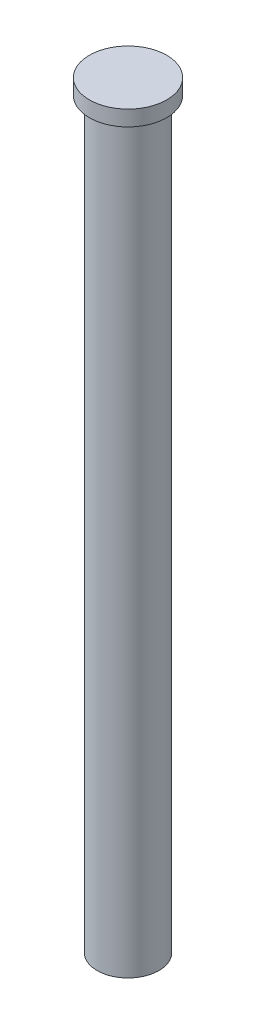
ISO-10303-21;
HEADER;
FILE_DESCRIPTION(('STEP AP214'),'2;1');
FILE_NAME('part.step','',(''),(''),'','','');
FILE_SCHEMA(('AUTOMOTIVE_DESIGN { 1 0 10303 214 1 1 1 1 }'));
ENDSEC;
DATA;
#1=APPLICATION_CONTEXT('core data for automotive mechanical design processes');
#2=APPLICATION_PROTOCOL_DEFINITION('international standard','automotive_design',2000,#1);
#3=PRODUCT_CONTEXT('',#1,'mechanical');
#4=PRODUCT('Part','Part','',(#3));
#5=PRODUCT_RELATED_PRODUCT_CATEGORY('part','',(#4));
#6=PRODUCT_DEFINITION_FORMATION('','',#4);
#7=PRODUCT_DEFINITION_CONTEXT('part definition',#1,'design');
#8=PRODUCT_DEFINITION('design','',#6,#7);
#9=PRODUCT_DEFINITION_SHAPE('','',#8);
#10=(LENGTH_UNIT() NAMED_UNIT(*) SI_UNIT(.MILLI.,.METRE.));
#11=(NAMED_UNIT(*) PLANE_ANGLE_UNIT() SI_UNIT($,.RADIAN.));
#12=(NAMED_UNIT(*) SI_UNIT($,.STERADIAN.) SOLID_ANGLE_UNIT());
#13=UNCERTAINTY_MEASURE_WITH_UNIT(LENGTH_MEASURE(1.E-05),#10,'distance_accuracy_value','');
#14=(GEOMETRIC_REPRESENTATION_CONTEXT(3) GLOBAL_UNCERTAINTY_ASSIGNED_CONTEXT((#13)) GLOBAL_UNIT_ASSIGNED_CONTEXT((#10,
#11,#12)) REPRESENTATION_CONTEXT('',''));
#15=CARTESIAN_POINT('',(0.,0.,0.));
#16=DIRECTION('',(0.,0.,1.));
#17=DIRECTION('',(1.,0.,0.));
#18=AXIS2_PLACEMENT_3D('',#15,#16,#17);
#19=CARTESIAN_POINT('',(0.,77.7875,0.));
#20=DIRECTION('',(0.,-1.,0.));
#21=DIRECTION('',(0.,0.,-1.));
#22=AXIS2_PLACEMENT_3D('',#19,#20,#21);
#23=PLANE('',#22);
#24=CARTESIAN_POINT('',(0.,77.7875,0.));
#25=DIRECTION('',(0.,-1.,0.));
#26=DIRECTION('',(0.,0.,-1.));
#27=AXIS2_PLACEMENT_3D('',#24,#25,#26);
#28=CIRCLE('',#27,3.96875);
#29=CARTESIAN_POINT('',(0.,77.7875,-3.96875));
#30=VERTEX_POINT('',#29);
#31=EDGE_CURVE('E10',#30,#30,#28,.T.);
#32=ORIENTED_EDGE('',*,*,#31,.F.);
#33=EDGE_LOOP('',(#32));
#34=FACE_BOUND('',#33,.T.);
#35=ADVANCED_FACE('F29',(#34),#23,.F.);
#36=CARTESIAN_POINT('',(0.,0.,0.));
#37=DIRECTION('',(0.,-1.,0.));
#38=DIRECTION('',(0.,0.,-1.));
#39=AXIS2_PLACEMENT_3D('',#36,#37,#38);
#40=CYLINDRICAL_SURFACE('',#39,3.96875);
#41=CARTESIAN_POINT('',(0.,76.2,0.));
#42=DIRECTION('',(0.,-1.,0.));
#43=DIRECTION('',(0.,0.,-1.));
#44=AXIS2_PLACEMENT_3D('',#41,#42,#43);
#45=CIRCLE('',#44,3.96875);
#46=CARTESIAN_POINT('',(0.,76.2,-3.96875));
#47=VERTEX_POINT('',#46);
#48=EDGE_CURVE('E35',#47,#47,#45,.T.);
#49=ORIENTED_EDGE('',*,*,#48,.F.);
#50=EDGE_LOOP('',(#49));
#51=FACE_BOUND('',#50,.T.);
#52=ORIENTED_EDGE('',*,*,#31,.T.);
#53=EDGE_LOOP('',(#52));
#54=FACE_BOUND('',#53,.T.);
#55=ADVANCED_FACE('F59',(#51,#54),#40,.T.);
#56=CARTESIAN_POINT('',(3.96875,76.2,0.));
#57=DIRECTION('',(0.,1.,0.));
#58=DIRECTION('',(0.,0.,1.));
#59=AXIS2_PLACEMENT_3D('',#56,#57,#58);
#60=PLANE('',#59);
#61=CARTESIAN_POINT('',(0.,76.2,0.));
#62=DIRECTION('',(0.,-1.,0.));
#63=DIRECTION('',(0.,0.,-1.));
#64=AXIS2_PLACEMENT_3D('',#61,#62,#63);
#65=CIRCLE('',#64,3.175);
#66=CARTESIAN_POINT('',(0.,76.2,-3.175));
#67=VERTEX_POINT('',#66);
#68=EDGE_CURVE('E39',#67,#67,#65,.T.);
#69=ORIENTED_EDGE('',*,*,#68,.F.);
#70=EDGE_LOOP('',(#69));
#71=FACE_BOUND('',#70,.T.);
#72=ORIENTED_EDGE('',*,*,#48,.T.);
#73=EDGE_LOOP('',(#72));
#74=FACE_BOUND('',#73,.T.);
#75=ADVANCED_FACE('F54',(#71,#74),#60,.F.);
#76=CARTESIAN_POINT('',(0.,0.,0.));
#77=DIRECTION('',(0.,-1.,0.));
#78=DIRECTION('',(0.,0.,-1.));
#79=AXIS2_PLACEMENT_3D('',#76,#77,#78);
#80=CYLINDRICAL_SURFACE('',#79,3.175);
#81=CARTESIAN_POINT('',(0.,0.,0.));
#82=DIRECTION('',(0.,-1.,0.));
#83=DIRECTION('',(0.,0.,-1.));
#84=AXIS2_PLACEMENT_3D('',#81,#82,#83);
#85=CIRCLE('',#84,3.175);
#86=CARTESIAN_POINT('',(0.,0.,-3.175));
#87=VERTEX_POINT('',#86);
#88=EDGE_CURVE('E43',#87,#87,#85,.T.);
#89=ORIENTED_EDGE('',*,*,#88,.F.);
#90=EDGE_LOOP('',(#89));
#91=FACE_BOUND('',#90,.T.);
#92=ORIENTED_EDGE('',*,*,#68,.T.);
#93=EDGE_LOOP('',(#92));
#94=FACE_BOUND('',#93,.T.);
#95=ADVANCED_FACE('F51',(#91,#94),#80,.T.);
#96=CARTESIAN_POINT('',(3.175,0.,0.));
#97=DIRECTION('',(0.,1.,0.));
#98=DIRECTION('',(0.,0.,1.));
#99=AXIS2_PLACEMENT_3D('',#96,#97,#98);
#100=PLANE('',#99);
#101=ORIENTED_EDGE('',*,*,#88,.T.);
#102=EDGE_LOOP('',(#101));
#103=FACE_BOUND('',#102,.T.);
#104=ADVANCED_FACE('F49',(#103),#100,.F.);
#105=CLOSED_SHELL('',(#35,#55,#75,#95,#104));
#106=MANIFOLD_SOLID_BREP('B2',#105);
#107=ADVANCED_BREP_SHAPE_REPRESENTATION('',(#18,#106),#14);
#108=SHAPE_DEFINITION_REPRESENTATION(#9,#107);
ENDSEC;
END-ISO-10303-21;
